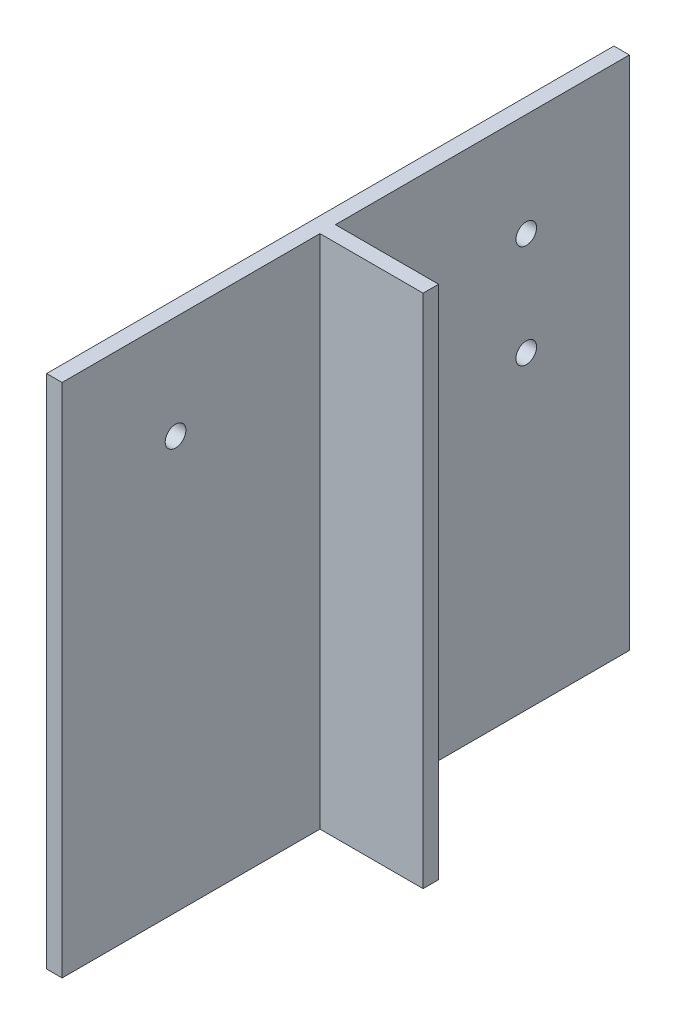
from build123d import *

# Parameters (mm, degrees)
SKETCH13_W         = 1100
SKETCH13_H         = 1000
EXTRUDE2_DEPTH     = 30
SKETCH14_R         = 20
EXTRUDE3_DEPTH     = 1487.909546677
SKETCH15_R         = 20
CUT_EXTRUDE1_DEPTH = 1487.909546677
SKETCH16_W         = 30
SKETCH16_H         = 1000
EXTRUDE4_DEPTH     = 200


with BuildPart() as part:
    # Sketch13 → Extrude2 (new body)
    with BuildSketch(Plane(origin=(0, 0, 0), x_dir=(0, 0, -1), z_dir=(1, 0, 0))):
        with Locations((550, 500)):
            Rectangle(SKETCH13_W, SKETCH13_H)
    extrude(amount=EXTRUDE2_DEPTH)

    # Sketch14 → Extrude3 (cut, through all)
    with BuildSketch(Plane(origin=(30, 0, 0), x_dir=(0, 0, -1), z_dir=(1, 0, 0))):
        with Locations((700, 800)):
            Circle(SKETCH14_R)
        with Locations((900, 600)):
            Circle(SKETCH14_R)
        with Locations((900, 800)):
            Circle(SKETCH14_R)
        with Locations((700, 600)):
            Circle(SKETCH14_R)
    extrude(amount=-EXTRUDE3_DEPTH, mode=Mode.SUBTRACT)

    # Sketch15 → Cut-Extrude1 (cut, through all)
    with BuildSketch(Plane(origin=(30, 0, 0), x_dir=(0, 0, -1), z_dir=(1, 0, 0))):
        with Locations((220, 800)):
            Circle(SKETCH15_R)
    extrude(amount=-CUT_EXTRUDE1_DEPTH, mode=Mode.SUBTRACT)

    # Sketch16 → Extrude4 (add)
    with BuildSketch(Plane(origin=(30, 0, 0), x_dir=(0, 0, -1), z_dir=(1, 0, 0))):
        with Locations((515, 500)):
            Rectangle(SKETCH16_W, SKETCH16_H)
    extrude(amount=EXTRUDE4_DEPTH)


solid = part.part
